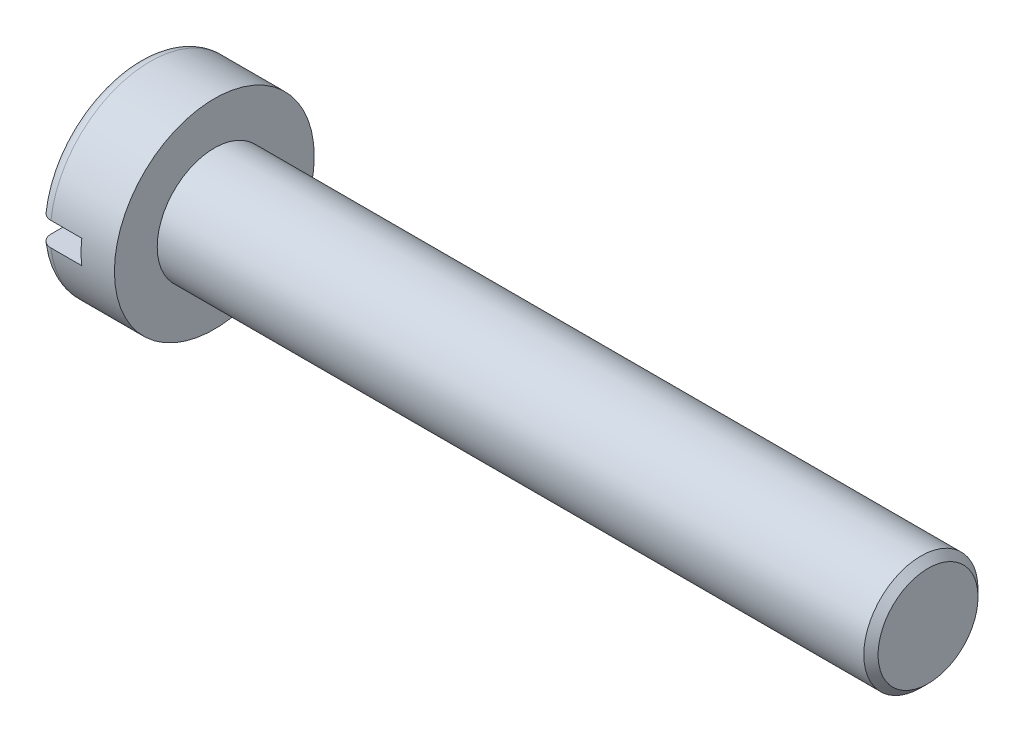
ISO-10303-21;
HEADER;
FILE_DESCRIPTION(('STEP AP214'),'2;1');
FILE_NAME('part.step','',(''),(''),'','','');
FILE_SCHEMA(('AUTOMOTIVE_DESIGN { 1 0 10303 214 1 1 1 1 }'));
ENDSEC;
DATA;
#1=APPLICATION_CONTEXT('core data for automotive mechanical design processes');
#2=APPLICATION_PROTOCOL_DEFINITION('international standard','automotive_design',2000,#1);
#3=PRODUCT_CONTEXT('',#1,'mechanical');
#4=PRODUCT('Part','Part','',(#3));
#5=PRODUCT_RELATED_PRODUCT_CATEGORY('part','',(#4));
#6=PRODUCT_DEFINITION_FORMATION('','',#4);
#7=PRODUCT_DEFINITION_CONTEXT('part definition',#1,'design');
#8=PRODUCT_DEFINITION('design','',#6,#7);
#9=PRODUCT_DEFINITION_SHAPE('','',#8);
#10=(LENGTH_UNIT() NAMED_UNIT(*) SI_UNIT(.MILLI.,.METRE.));
#11=(NAMED_UNIT(*) PLANE_ANGLE_UNIT() SI_UNIT($,.RADIAN.));
#12=(NAMED_UNIT(*) SI_UNIT($,.STERADIAN.) SOLID_ANGLE_UNIT());
#13=UNCERTAINTY_MEASURE_WITH_UNIT(LENGTH_MEASURE(1.E-05),#10,'distance_accuracy_value','');
#14=(GEOMETRIC_REPRESENTATION_CONTEXT(3) GLOBAL_UNCERTAINTY_ASSIGNED_CONTEXT((#13)) GLOBAL_UNIT_ASSIGNED_CONTEXT((#10,
#11,#12)) REPRESENTATION_CONTEXT('',''));
#15=CARTESIAN_POINT('',(0.,0.,0.));
#16=DIRECTION('',(0.,0.,1.));
#17=DIRECTION('',(1.,0.,0.));
#18=AXIS2_PLACEMENT_3D('',#15,#16,#17);
#19=CARTESIAN_POINT('',(3.2,0.,0.));
#20=DIRECTION('',(-1.,0.,0.));
#21=DIRECTION('',(0.,0.,1.));
#22=AXIS2_PLACEMENT_3D('',#19,#20,#21);
#23=PLANE('',#22);
#24=CARTESIAN_POINT('',(3.2,0.,0.));
#25=DIRECTION('',(-1.,0.,0.));
#26=DIRECTION('',(0.,0.,1.));
#27=AXIS2_PLACEMENT_3D('',#24,#25,#26);
#28=CIRCLE('',#27,4.2);
#29=CARTESIAN_POINT('',(3.2,0.,4.2));
#30=VERTEX_POINT('',#29);
#31=EDGE_CURVE('E196',#30,#30,#28,.T.);
#32=ORIENTED_EDGE('',*,*,#31,.F.);
#33=EDGE_LOOP('',(#32));
#34=FACE_BOUND('',#33,.T.);
#35=CARTESIAN_POINT('',(3.2,0.,0.));
#36=DIRECTION('',(-1.,0.,0.));
#37=DIRECTION('',(0.,0.,1.));
#38=AXIS2_PLACEMENT_3D('',#35,#36,#37);
#39=CIRCLE('',#38,2.4);
#40=CARTESIAN_POINT('',(3.2,0.,2.4));
#41=VERTEX_POINT('',#40);
#42=EDGE_CURVE('E123',#41,#41,#39,.F.);
#43=ORIENTED_EDGE('',*,*,#42,.F.);
#44=EDGE_LOOP('',(#43));
#45=FACE_BOUND('',#44,.T.);
#46=ADVANCED_FACE('F31',(#34,#45),#23,.F.);
#47=CARTESIAN_POINT('',(0.,0.,0.));
#48=DIRECTION('',(1.,0.,0.));
#49=DIRECTION('',(0.,0.,-1.));
#50=AXIS2_PLACEMENT_3D('',#47,#48,#49);
#51=PLANE('',#50);
#52=CARTESIAN_POINT('',(0.,0.,0.));
#53=DIRECTION('',(-1.,0.,0.));
#54=DIRECTION('',(0.,0.,1.));
#55=AXIS2_PLACEMENT_3D('',#52,#53,#54);
#56=CIRCLE('',#55,3.7);
#57=CARTESIAN_POINT('',(0.,0.5,3.66606055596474));
#58=VERTEX_POINT('',#57);
#59=CARTESIAN_POINT('',(0.,0.5,-3.66606055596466));
#60=VERTEX_POINT('',#59);
#61=EDGE_CURVE('E101',#58,#60,#56,.T.);
#62=ORIENTED_EDGE('',*,*,#61,.T.);
#63=DIRECTION('',(0.,0.,1.));
#64=VECTOR('',#63,1.);
#65=CARTESIAN_POINT('',(0.,0.5,-5.));
#66=LINE('',#65,#64);
#67=EDGE_CURVE('E94',#60,#58,#66,.T.);
#68=ORIENTED_EDGE('',*,*,#67,.T.);
#69=EDGE_LOOP('',(#62,#68));
#70=FACE_BOUND('',#69,.T.);
#71=ADVANCED_FACE('F141',(#70),#51,.F.);
#72=CARTESIAN_POINT('',(0.5,0.,0.));
#73=DIRECTION('',(-1.,0.,0.));
#74=DIRECTION('',(0.,0.,1.));
#75=AXIS2_PLACEMENT_3D('',#72,#73,#74);
#76=TOROIDAL_SURFACE('',#75,3.7,0.5);
#77=CARTESIAN_POINT('',(0.500000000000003,0.,0.));
#78=DIRECTION('',(-1.,0.,0.));
#79=DIRECTION('',(0.,0.,1.));
#80=AXIS2_PLACEMENT_3D('',#77,#78,#79);
#81=CIRCLE('',#80,4.2);
#82=CARTESIAN_POINT('',(0.500000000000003,0.5,4.17013189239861));
#83=VERTEX_POINT('',#82);
#84=CARTESIAN_POINT('',(0.500000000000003,0.5,-4.17013189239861));
#85=VERTEX_POINT('',#84);
#86=EDGE_CURVE('E102',#83,#85,#81,.T.);
#87=ORIENTED_EDGE('',*,*,#86,.T.);
#88=CARTESIAN_POINT('',(0.157998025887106,0.5,-4.03386965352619));
#89=CARTESIAN_POINT('',(0.137412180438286,0.5,-4.01441757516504));
#90=CARTESIAN_POINT('',(0.118463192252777,0.5,-3.99320166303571));
#91=CARTESIAN_POINT('',(0.0843886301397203,0.5,-3.94786589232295));
#92=CARTESIAN_POINT('',(0.0692680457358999,0.5,-3.92374230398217));
#93=CARTESIAN_POINT('',(0.0432944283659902,0.5,-3.87332056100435));
#94=CARTESIAN_POINT('',(0.0324379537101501,0.5,-3.84702418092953));
#95=CARTESIAN_POINT('',(0.0152697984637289,0.5,-3.79299650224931));
#96=CARTESIAN_POINT('',(0.00895699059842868,0.5,-3.76526556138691));
#97=CARTESIAN_POINT('',(0.00101167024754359,0.5,-3.70898212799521));
#98=CARTESIAN_POINT('',(-0.00059437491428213,0.5,-3.68042589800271));
#99=CARTESIAN_POINT('',(0.000986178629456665,0.5,-3.62344484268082));
#100=CARTESIAN_POINT('',(0.00417313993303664,0.5,-3.59502002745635));
#101=CARTESIAN_POINT('',(0.0152755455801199,0.5,-3.5389709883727));
#102=CARTESIAN_POINT('',(0.0232129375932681,0.5,-3.51135110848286));
#103=CARTESIAN_POINT('',(0.0436161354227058,0.5,-3.45783714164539));
#104=CARTESIAN_POINT('',(0.0560819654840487,0.5,-3.43194306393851));
#105=CARTESIAN_POINT('',(0.085185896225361,0.5,-3.38265105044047));
#106=CARTESIAN_POINT('',(0.101819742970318,0.5,-3.35925060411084));
#107=CARTESIAN_POINT('',(0.138807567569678,0.5,-3.31560112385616));
#108=CARTESIAN_POINT('',(0.159161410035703,0.5,-3.29535197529));
#109=CARTESIAN_POINT('',(0.20285214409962,0.5,-3.25875120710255));
#110=CARTESIAN_POINT('',(0.226165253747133,0.5,-3.24237120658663));
#111=CARTESIAN_POINT('',(0.275235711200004,0.5,-3.21380989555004));
#112=CARTESIAN_POINT('',(0.300992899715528,0.5,-3.20162831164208));
#113=CARTESIAN_POINT('',(0.353909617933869,0.5,-3.18195357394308));
#114=CARTESIAN_POINT('',(0.381050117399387,0.5,-3.17440923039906));
#115=CARTESIAN_POINT('',(0.436216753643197,0.5,-3.16402928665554));
#116=CARTESIAN_POINT('',(0.464242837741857,0.5,-3.16119340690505));
#117=CARTESIAN_POINT('',(0.520123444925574,0.5,-3.16032254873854));
#118=CARTESIAN_POINT('',(0.547977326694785,0.5,-3.16224582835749));
#119=CARTESIAN_POINT('',(0.602964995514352,0.5,-3.17074606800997));
#120=CARTESIAN_POINT('',(0.63009879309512,0.5,-3.17732295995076));
#121=CARTESIAN_POINT('',(0.682859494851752,0.5,-3.19492212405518));
#122=CARTESIAN_POINT('',(0.708487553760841,0.5,-3.20594093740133));
#123=CARTESIAN_POINT('',(0.757549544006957,0.5,-3.23209329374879));
#124=CARTESIAN_POINT('',(0.78098340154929,0.5,-3.24722697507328));
#125=CARTESIAN_POINT('',(0.825187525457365,0.5,-3.28129562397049));
#126=CARTESIAN_POINT('',(0.845936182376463,0.5,-3.30025862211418));
#127=CARTESIAN_POINT('',(0.883999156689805,0.5,-3.34136426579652));
#128=CARTESIAN_POINT('',(0.901313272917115,0.5,-3.3635070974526));
#129=CARTESIAN_POINT('',(0.932219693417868,0.5,-3.41061053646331));
#130=CARTESIAN_POINT('',(0.945768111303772,0.5,-3.43559994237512));
#131=CARTESIAN_POINT('',(0.968519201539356,0.5,-3.48748444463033));
#132=CARTESIAN_POINT('',(0.97772165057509,0.5,-3.51437963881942));
#133=CARTESIAN_POINT('',(0.991593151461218,0.5,-3.56956352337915));
#134=CARTESIAN_POINT('',(0.996222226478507,0.5,-3.59786226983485));
#135=CARTESIAN_POINT('',(1.00067717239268,0.5,-3.6548357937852));
#136=CARTESIAN_POINT('',(1.00050293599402,0.5,-3.68351057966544));
#137=CARTESIAN_POINT('',(0.995343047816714,0.5,-3.74049682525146));
#138=CARTESIAN_POINT('',(0.990345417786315,0.5,-3.76880720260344));
#139=CARTESIAN_POINT('',(0.975650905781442,0.5,-3.82418146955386));
#140=CARTESIAN_POINT('',(0.965954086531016,0.5,-3.85124537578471));
#141=CARTESIAN_POINT('',(0.942166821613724,0.5,-3.90324980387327));
#142=CARTESIAN_POINT('',(0.928092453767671,0.5,-3.92819767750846));
#143=CARTESIAN_POINT('',(0.895926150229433,0.5,-3.97535354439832));
#144=CARTESIAN_POINT('',(0.877834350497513,0.5,-3.99756163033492));
#145=CARTESIAN_POINT('',(0.83828513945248,0.5,-4.03843509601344));
#146=CARTESIAN_POINT('',(0.816852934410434,0.5,-4.05712486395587));
#147=CARTESIAN_POINT('',(0.771134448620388,0.5,-4.09060784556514));
#148=CARTESIAN_POINT('',(0.746848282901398,0.5,-4.10540121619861));
#149=CARTESIAN_POINT('',(0.696309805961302,0.5,-4.13055499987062));
#150=CARTESIAN_POINT('',(0.670073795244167,0.5,-4.14094816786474));
#151=CARTESIAN_POINT('',(0.616224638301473,0.5,-4.15715477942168));
#152=CARTESIAN_POINT('',(0.588611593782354,0.5,-4.16296856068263));
#153=CARTESIAN_POINT('',(0.532954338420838,0.5,-4.16982542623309));
#154=CARTESIAN_POINT('',(0.504913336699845,0.5,-4.17089458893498));
#155=CARTESIAN_POINT('',(0.449043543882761,0.5,-4.16830105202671));
#156=CARTESIAN_POINT('',(0.421214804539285,0.5,-4.16463723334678));
#157=CARTESIAN_POINT('',(0.366604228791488,0.5,-4.1526934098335));
#158=CARTESIAN_POINT('',(0.339821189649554,0.5,-4.1444188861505));
#159=CARTESIAN_POINT('',(0.288043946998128,0.5,-4.12350467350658));
#160=CARTESIAN_POINT('',(0.263047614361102,0.5,-4.11087028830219));
#161=CARTESIAN_POINT('',(0.224722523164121,0.5,-4.08728071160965));
#162=CARTESIAN_POINT('',(0.210616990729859,0.5,-4.07756252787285));
#163=CARTESIAN_POINT('',(0.183474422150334,0.5,-4.05673412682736));
#164=CARTESIAN_POINT('',(0.170437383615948,0.5,-4.04562391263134));
#165=CARTESIAN_POINT('',(0.157998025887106,0.5,-4.03386965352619));
#166=B_SPLINE_CURVE_WITH_KNOTS('',3,(#88,#89,#90,#91,#92,#93,#94,#95,#96,#97,#98,#99,#100,#101,
#102,#103,#104,#105,#106,#107,#108,#109,#110,#111,#112,#113,#114,#115,#116,#117,#118,#119,#120,
#121,#122,#123,#124,#125,#126,#127,#128,#129,#130,#131,#132,#133,#134,#135,#136,#137,#138,#139,
#140,#141,#142,#143,#144,#145,#146,#147,#148,#149,#150,#151,#152,#153,#154,#155,#156,#157,#158,
#159,#160,#161,#162,#163,#164,#165),.UNSPECIFIED.,.T.,.F.,(4,2,2,2,2,2,2,2,2,2,2,2,2,2,2,2,2,2,
2,2,2,2,2,2,2,2,2,2,2,2,2,2,2,2,2,2,2,2,4),(0.,0.0849042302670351,0.169918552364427,
0.254864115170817,0.339788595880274,0.425189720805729,0.510597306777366,0.596402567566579,
0.682208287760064,0.767926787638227,0.853642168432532,0.93870780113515,1.02376789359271,
1.10787131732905,1.19196974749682,1.27533318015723,1.35869539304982,1.4419928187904,
1.52529304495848,1.60922670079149,1.6931652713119,1.77804457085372,1.86292823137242,
1.94854748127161,2.03416864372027,2.12000298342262,2.20583617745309,2.29135777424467,
2.37687647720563,2.4617785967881,2.54667729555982,2.6309323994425,2.71518128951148,
2.79896653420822,2.88277159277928,2.96647723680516,3.05008141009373,3.10138639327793,
3.1526912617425),.UNSPECIFIED.);
#167=EDGE_CURVE('E54',#85,#60,#166,.T.);
#168=ORIENTED_EDGE('',*,*,#167,.T.);
#169=ORIENTED_EDGE('',*,*,#61,.F.);
#170=CARTESIAN_POINT('',(0.404900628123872,0.5,3.16993649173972));
#171=CARTESIAN_POINT('',(0.377452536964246,0.5,3.17532124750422));
#172=CARTESIAN_POINT('',(0.350441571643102,0.5,3.18304417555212));
#173=CARTESIAN_POINT('',(0.298083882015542,0.5,3.20293605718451));
#174=CARTESIAN_POINT('',(0.272739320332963,0.5,3.21511065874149));
#175=CARTESIAN_POINT('',(0.22447032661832,0.5,3.24352369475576));
#176=CARTESIAN_POINT('',(0.201543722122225,0.5,3.25975843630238));
#177=CARTESIAN_POINT('',(0.15872121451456,0.5,3.29581366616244));
#178=CARTESIAN_POINT('',(0.138824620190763,0.5,3.31563333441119));
#179=CARTESIAN_POINT('',(0.102444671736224,0.5,3.35846150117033));
#180=CARTESIAN_POINT('',(0.0859894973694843,0.5,3.38149393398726));
#181=CARTESIAN_POINT('',(0.0571324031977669,0.5,3.42997268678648));
#182=CARTESIAN_POINT('',(0.0447308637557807,0.5,3.45541923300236));
#183=CARTESIAN_POINT('',(0.0242076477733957,0.5,3.50828386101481));
#184=CARTESIAN_POINT('',(0.0161310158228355,0.5,3.53571943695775));
#185=CARTESIAN_POINT('',(0.00467263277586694,0.5,3.59155439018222));
#186=CARTESIAN_POINT('',(0.0012910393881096,0.5,3.61995379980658));
#187=CARTESIAN_POINT('',(-0.000685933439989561,0.5,3.67706064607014));
#188=CARTESIAN_POINT('',(0.000742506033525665,0.5,3.70576891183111));
#189=CARTESIAN_POINT('',(0.00840618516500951,0.5,3.76253700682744));
#190=CARTESIAN_POINT('',(0.0146414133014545,0.5,3.79059683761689));
#191=CARTESIAN_POINT('',(0.0317408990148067,0.5,3.84522111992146));
#192=CARTESIAN_POINT('',(0.0425978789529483,0.5,3.87178784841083));
#193=CARTESIAN_POINT('',(0.0686452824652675,0.5,3.92270508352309));
#194=CARTESIAN_POINT('',(0.083835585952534,0.5,3.94705565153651));
#195=CARTESIAN_POINT('',(0.118019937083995,0.5,3.9926838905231));
#196=CARTESIAN_POINT('',(0.136989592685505,0.5,4.01397983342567));
#197=CARTESIAN_POINT('',(0.178260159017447,0.5,4.05305361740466));
#198=CARTESIAN_POINT('',(0.200560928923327,0.5,4.0708316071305));
#199=CARTESIAN_POINT('',(0.247673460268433,0.5,4.10221823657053));
#200=CARTESIAN_POINT('',(0.272464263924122,0.5,4.11585833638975));
#201=CARTESIAN_POINT('',(0.323994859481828,0.5,4.13875169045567));
#202=CARTESIAN_POINT('',(0.350734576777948,0.5,4.14800511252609));
#203=CARTESIAN_POINT('',(0.405218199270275,0.5,4.16180468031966));
#204=CARTESIAN_POINT('',(0.43295451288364,0.5,4.166380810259));
#205=CARTESIAN_POINT('',(0.48880142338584,0.5,4.1707952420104));
#206=CARTESIAN_POINT('',(0.516912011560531,0.5,4.17063365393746));
#207=CARTESIAN_POINT('',(0.572615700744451,0.5,4.16558569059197));
#208=CARTESIAN_POINT('',(0.600210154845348,0.5,4.16071422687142));
#209=CARTESIAN_POINT('',(0.654190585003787,0.5,4.14641186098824));
#210=CARTESIAN_POINT('',(0.680576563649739,0.5,4.13698096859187));
#211=CARTESIAN_POINT('',(0.731421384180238,0.5,4.11382458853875));
#212=CARTESIAN_POINT('',(0.755878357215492,0.5,4.1000949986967));
#213=CARTESIAN_POINT('',(0.802154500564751,0.5,4.06874325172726));
#214=CARTESIAN_POINT('',(0.823973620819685,0.5,4.05112102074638));
#215=CARTESIAN_POINT('',(0.864470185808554,0.5,4.01239760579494));
#216=CARTESIAN_POINT('',(0.88313205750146,0.5,3.99128013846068));
#217=CARTESIAN_POINT('',(0.916676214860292,0.5,3.94623136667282));
#218=CARTESIAN_POINT('',(0.931558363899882,0.5,3.92229996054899));
#219=CARTESIAN_POINT('',(0.957237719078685,0.5,3.87211629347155));
#220=CARTESIAN_POINT('',(0.968004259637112,0.5,3.84584834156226));
#221=CARTESIAN_POINT('',(0.985011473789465,0.5,3.79188619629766));
#222=CARTESIAN_POINT('',(0.991251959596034,0.5,3.76419194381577));
#223=CARTESIAN_POINT('',(0.999075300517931,0.5,3.70794116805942));
#224=CARTESIAN_POINT('',(1.00062287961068,0.5,3.67937973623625));
#225=CARTESIAN_POINT('',(0.998925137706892,0.5,3.62239929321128));
#226=CARTESIAN_POINT('',(0.99567964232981,0.5,3.59398028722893));
#227=CARTESIAN_POINT('',(0.984461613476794,0.5,3.53795310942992));
#228=CARTESIAN_POINT('',(0.976467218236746,0.5,3.51034931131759));
#229=CARTESIAN_POINT('',(0.955953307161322,0.5,3.45687685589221));
#230=CARTESIAN_POINT('',(0.943433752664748,0.5,3.4310082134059));
#231=CARTESIAN_POINT('',(0.914227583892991,0.5,3.38177649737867));
#232=CARTESIAN_POINT('',(0.897545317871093,0.5,3.35841084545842));
#233=CARTESIAN_POINT('',(0.860467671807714,0.5,3.31483966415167));
#234=CARTESIAN_POINT('',(0.840072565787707,0.5,3.29463390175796));
#235=CARTESIAN_POINT('',(0.796310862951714,0.5,3.25812864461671));
#236=CARTESIAN_POINT('',(0.772968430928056,0.5,3.24180018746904));
#237=CARTESIAN_POINT('',(0.723841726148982,0.5,3.21334216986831));
#238=CARTESIAN_POINT('',(0.698056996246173,0.5,3.20121339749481));
#239=CARTESIAN_POINT('',(0.645084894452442,0.5,3.18164302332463));
#240=CARTESIAN_POINT('',(0.61791561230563,0.5,3.17415236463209));
#241=CARTESIAN_POINT('',(0.562723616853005,0.5,3.16389449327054));
#242=CARTESIAN_POINT('',(0.534702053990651,0.5,3.16112117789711));
#243=CARTESIAN_POINT('',(0.489604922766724,0.5,3.16050983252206));
#244=CARTESIAN_POINT('',(0.472536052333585,0.5,3.16116543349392));
#245=CARTESIAN_POINT('',(0.438557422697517,0.5,3.16423605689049));
#246=CARTESIAN_POINT('',(0.421647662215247,0.5,3.16665106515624));
#247=CARTESIAN_POINT('',(0.404900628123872,0.5,3.16993649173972));
#248=B_SPLINE_CURVE_WITH_KNOTS('',3,(#170,#171,#172,#173,#174,#175,#176,#177,#178,#179,#180,
#181,#182,#183,#184,#185,#186,#187,#188,#189,#190,#191,#192,#193,#194,#195,#196,#197,#198,#199,
#200,#201,#202,#203,#204,#205,#206,#207,#208,#209,#210,#211,#212,#213,#214,#215,#216,#217,#218,
#219,#220,#221,#222,#223,#224,#225,#226,#227,#228,#229,#230,#231,#232,#233,#234,#235,#236,#237,
#238,#239,#240,#241,#242,#243,#244,#245,#246,#247),.UNSPECIFIED.,.T.,.F.,(4,2,2,2,2,2,2,2,2,2,2,
2,2,2,2,2,2,2,2,2,2,2,2,2,2,2,2,2,2,2,2,2,2,2,2,2,2,2,4),(0.,0.0838508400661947,
0.167808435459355,0.251689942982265,0.335552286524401,0.420076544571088,0.504608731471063,
0.590005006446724,0.675404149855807,0.761226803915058,0.847049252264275,0.932737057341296,
1.01842248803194,1.10357184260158,1.18871759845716,1.27319876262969,1.35767669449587,
1.44160961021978,1.52554057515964,1.6092066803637,1.69287260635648,1.77661861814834,
1.86036621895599,1.94451556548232,2.02866795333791,2.11343567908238,2.19820692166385,
2.28361381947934,2.36902382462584,2.45483009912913,2.54063710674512,2.626354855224,
2.71206627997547,2.79711576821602,2.88218120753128,2.96633082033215,3.05037148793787,
3.10153221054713,3.15269252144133),.UNSPECIFIED.);
#249=EDGE_CURVE('E173',#58,#83,#248,.T.);
#250=ORIENTED_EDGE('',*,*,#249,.T.);
#251=EDGE_LOOP('',(#87,#168,#169,#250));
#252=FACE_BOUND('',#251,.T.);
#253=ADVANCED_FACE('F149',(#252),#76,.T.);
#254=CARTESIAN_POINT('',(0.,-0.5,-3.66606055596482));
#255=VERTEX_POINT('',#254);
#256=CARTESIAN_POINT('',(0.,-0.5,3.66606055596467));
#257=VERTEX_POINT('',#256);
#258=EDGE_CURVE('E98',#255,#257,#56,.T.);
#259=ORIENTED_EDGE('',*,*,#258,.T.);
#260=DIRECTION('',(0.,0.,1.));
#261=VECTOR('',#260,1.);
#262=CARTESIAN_POINT('',(0.,-0.5,-5.));
#263=LINE('',#262,#261);
#264=EDGE_CURVE('E85',#255,#257,#263,.T.);
#265=ORIENTED_EDGE('',*,*,#264,.F.);
#266=EDGE_LOOP('',(#259,#265));
#267=FACE_BOUND('',#266,.T.);
#268=ADVANCED_FACE('F33',(#267),#51,.F.);
#269=ORIENTED_EDGE('',*,*,#258,.F.);
#270=CARTESIAN_POINT('',(0.157998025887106,-0.5,-4.03386965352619));
#271=CARTESIAN_POINT('',(0.178364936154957,-0.5,-4.05311141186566));
#272=CARTESIAN_POINT('',(0.200363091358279,-0.5,-4.07065488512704));
#273=CARTESIAN_POINT('',(0.24700750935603,-0.5,-4.10181854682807));
#274=CARTESIAN_POINT('',(0.271656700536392,-0.5,-4.11543433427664));
#275=CARTESIAN_POINT('',(0.32289094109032,-0.5,-4.13832407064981));
#276=CARTESIAN_POINT('',(0.349475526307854,-0.5,-4.14759905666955));
#277=CARTESIAN_POINT('',(0.403821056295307,-0.5,-4.16153354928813));
#278=CARTESIAN_POINT('',(0.431581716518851,-0.5,-4.16619416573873));
#279=CARTESIAN_POINT('',(0.487396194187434,-0.5,-4.1707583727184));
#280=CARTESIAN_POINT('',(0.515448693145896,-0.5,-4.17067809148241));
#281=CARTESIAN_POINT('',(0.571141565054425,-0.5,-4.1658027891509));
#282=CARTESIAN_POINT('',(0.598781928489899,-0.5,-4.16100765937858));
#283=CARTESIAN_POINT('',(0.652832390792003,-0.5,-4.14685238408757));
#284=CARTESIAN_POINT('',(0.679243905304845,-0.5,-4.13749764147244));
#285=CARTESIAN_POINT('',(0.730127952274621,-0.5,-4.11449942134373));
#286=CARTESIAN_POINT('',(0.75460047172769,-0.5,-4.10085591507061));
#287=CARTESIAN_POINT('',(0.800992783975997,-0.5,-4.06962992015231));
#288=CARTESIAN_POINT('',(0.822904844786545,-0.5,-4.05203594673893));
#289=CARTESIAN_POINT('',(0.863486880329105,-0.5,-4.01343987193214));
#290=CARTESIAN_POINT('',(0.882156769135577,-0.5,-3.99243768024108));
#291=CARTESIAN_POINT('',(0.915852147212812,-0.5,-3.9474828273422));
#292=CARTESIAN_POINT('',(0.930854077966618,-0.5,-3.92351251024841));
#293=CARTESIAN_POINT('',(0.956656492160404,-0.5,-3.87340854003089));
#294=CARTESIAN_POINT('',(0.967456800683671,-0.5,-3.84727479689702));
#295=CARTESIAN_POINT('',(0.984637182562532,-0.5,-3.79336919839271));
#296=CARTESIAN_POINT('',(0.990982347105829,-0.5,-3.76558621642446));
#297=CARTESIAN_POINT('',(0.998951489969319,-0.5,-3.70935113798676));
#298=CARTESIAN_POINT('',(1.00057527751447,-0.5,-3.68089901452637));
#299=CARTESIAN_POINT('',(0.999059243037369,-0.5,-3.62393650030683));
#300=CARTESIAN_POINT('',(0.995888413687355,-0.5,-3.59542693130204));
#301=CARTESIAN_POINT('',(0.984816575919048,-0.5,-3.53934099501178));
#302=CARTESIAN_POINT('',(0.976915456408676,-0.5,-3.51176464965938));
#303=CARTESIAN_POINT('',(0.956577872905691,-0.5,-3.45827033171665));
#304=CARTESIAN_POINT('',(0.944131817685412,-0.5,-3.43235600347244));
#305=CARTESIAN_POINT('',(0.915047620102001,-0.5,-3.38299648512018));
#306=CARTESIAN_POINT('',(0.898409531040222,-0.5,-3.35955126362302));
#307=CARTESIAN_POINT('',(0.861482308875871,-0.5,-3.31591360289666));
#308=CARTESIAN_POINT('',(0.841209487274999,-0.5,-3.29570736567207));
#309=CARTESIAN_POINT('',(0.797529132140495,-0.5,-3.25902686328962));
#310=CARTESIAN_POINT('',(0.774121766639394,-0.5,-3.24255239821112));
#311=CARTESIAN_POINT('',(0.725085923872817,-0.5,-3.21398321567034));
#312=CARTESIAN_POINT('',(0.699482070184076,-0.5,-3.20184624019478));
#313=CARTESIAN_POINT('',(0.646585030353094,-0.5,-3.18209713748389));
#314=CARTESIAN_POINT('',(0.619291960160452,-0.5,-3.17448470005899));
#315=CARTESIAN_POINT('',(0.56410940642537,-0.5,-3.16407974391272));
#316=CARTESIAN_POINT('',(0.536229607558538,-0.5,-3.16123582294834));
#317=CARTESIAN_POINT('',(0.480390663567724,-0.5,-3.1602962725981));
#318=CARTESIAN_POINT('',(0.452431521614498,-0.5,-3.16220045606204));
#319=CARTESIAN_POINT('',(0.397380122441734,-0.5,-3.17067517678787));
#320=CARTESIAN_POINT('',(0.370284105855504,-0.5,-3.17722133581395));
#321=CARTESIAN_POINT('',(0.317569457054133,-0.5,-3.19475335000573));
#322=CARTESIAN_POINT('',(0.291950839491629,-0.5,-3.20573924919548));
#323=CARTESIAN_POINT('',(0.242809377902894,-0.5,-3.23187042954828));
#324=CARTESIAN_POINT('',(0.219294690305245,-0.5,-3.24703104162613));
#325=CARTESIAN_POINT('',(0.175110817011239,-0.5,-3.28104746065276));
#326=CARTESIAN_POINT('',(0.154441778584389,-0.5,-3.29990345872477));
#327=CARTESIAN_POINT('',(0.116309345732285,-0.5,-3.34097876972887));
#328=CARTESIAN_POINT('',(0.0988807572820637,-0.5,-3.36323039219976));
#329=CARTESIAN_POINT('',(0.0679596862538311,-0.5,-3.41031826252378));
#330=CARTESIAN_POINT('',(0.0544674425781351,-0.5,-3.43515466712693));
#331=CARTESIAN_POINT('',(0.0316568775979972,-0.5,-3.48699214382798));
#332=CARTESIAN_POINT('',(0.0223844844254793,-0.5,-3.5140134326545));
#333=CARTESIAN_POINT('',(0.00847833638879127,-0.5,-3.5692235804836));
#334=CARTESIAN_POINT('',(0.00384458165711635,-0.5,-3.59741243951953));
#335=CARTESIAN_POINT('',(-0.000668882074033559,-0.5,-3.65433079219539));
#336=CARTESIAN_POINT('',(-0.000521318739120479,-0.5,-3.68306245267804));
#337=CARTESIAN_POINT('',(0.00459920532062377,-0.5,-3.74010087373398));
#338=CARTESIAN_POINT('',(0.00957337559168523,-0.5,-3.76840752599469));
#339=CARTESIAN_POINT('',(0.0242151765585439,-0.5,-3.82376911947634));
#340=CARTESIAN_POINT('',(0.0338814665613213,-0.5,-3.85082441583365));
#341=CARTESIAN_POINT('',(0.0576407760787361,-0.5,-3.90288951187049));
#342=CARTESIAN_POINT('',(0.0717283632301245,-0.5,-3.92790177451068));
#343=CARTESIAN_POINT('',(0.0979938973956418,-0.5,-3.96646105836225));
#344=CARTESIAN_POINT('',(0.108969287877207,-0.5,-3.98084207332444));
#345=CARTESIAN_POINT('',(0.132402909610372,-0.5,-4.00834079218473));
#346=CARTESIAN_POINT('',(0.144861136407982,-0.5,-4.0214584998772));
#347=CARTESIAN_POINT('',(0.157998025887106,-0.5,-4.03386965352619));
#348=B_SPLINE_CURVE_WITH_KNOTS('',3,(#270,#271,#272,#273,#274,#275,#276,#277,#278,#279,#280,
#281,#282,#283,#284,#285,#286,#287,#288,#289,#290,#291,#292,#293,#294,#295,#296,#297,#298,#299,
#300,#301,#302,#303,#304,#305,#306,#307,#308,#309,#310,#311,#312,#313,#314,#315,#316,#317,#318,
#319,#320,#321,#322,#323,#324,#325,#326,#327,#328,#329,#330,#331,#332,#333,#334,#335,#336,#337,
#338,#339,#340,#341,#342,#343,#344,#345,#346,#347),.UNSPECIFIED.,.T.,.F.,(4,2,2,2,2,2,2,2,2,2,2,
2,2,2,2,2,2,2,2,2,2,2,2,2,2,2,2,2,2,2,2,2,2,2,2,2,2,2,4),(0.,0.0839911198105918,
0.168075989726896,0.252140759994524,0.336185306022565,0.419943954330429,0.503704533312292,
0.587366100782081,0.671028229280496,0.754936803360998,0.838847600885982,0.923283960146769,
1.00772383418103,1.09281817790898,1.17791595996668,1.26356643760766,1.34921892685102,
1.43505322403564,1.52088642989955,1.6063436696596,1.69179633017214,1.77639218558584,
1.86098224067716,1.94465445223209,2.02832336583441,2.11155609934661,2.19478965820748,
2.27833305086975,2.36188076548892,2.44627969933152,2.53068375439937,2.61598568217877,
2.70128761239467,2.78707618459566,2.87288626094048,2.95867183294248,3.0443524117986,
3.09852780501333,3.15270303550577),.UNSPECIFIED.);
#349=CARTESIAN_POINT('',(0.500000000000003,-0.5,-4.17013189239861));
#350=VERTEX_POINT('',#349);
#351=EDGE_CURVE('E82',#255,#350,#348,.T.);
#352=ORIENTED_EDGE('',*,*,#351,.T.);
#353=CARTESIAN_POINT('',(0.500000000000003,-0.5,4.17013189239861));
#354=VERTEX_POINT('',#353);
#355=EDGE_CURVE('E106',#350,#354,#81,.T.);
#356=ORIENTED_EDGE('',*,*,#355,.T.);
#357=CARTESIAN_POINT('',(0.404900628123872,-0.5,3.16993649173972));
#358=CARTESIAN_POINT('',(0.432155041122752,-0.5,3.16459236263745));
#359=CARTESIAN_POINT('',(0.459880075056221,-0.5,3.16154554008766));
#360=CARTESIAN_POINT('',(0.515469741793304,-0.5,3.16015435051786));
#361=CARTESIAN_POINT('',(0.543334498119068,-0.5,3.16181537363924));
#362=CARTESIAN_POINT('',(0.598375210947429,-0.5,3.16979391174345));
#363=CARTESIAN_POINT('',(0.62555154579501,-0.5,3.17610880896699));
#364=CARTESIAN_POINT('',(0.67845554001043,-0.5,3.19319783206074));
#365=CARTESIAN_POINT('',(0.704183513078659,-0.5,3.20397098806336));
#366=CARTESIAN_POINT('',(0.75355506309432,-0.5,3.22968972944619));
#367=CARTESIAN_POINT('',(0.777192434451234,-0.5,3.24464722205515));
#368=CARTESIAN_POINT('',(0.821654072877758,-0.5,3.2782814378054));
#369=CARTESIAN_POINT('',(0.842478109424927,-0.5,3.29695846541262));
#370=CARTESIAN_POINT('',(0.880947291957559,-0.5,3.3377003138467));
#371=CARTESIAN_POINT('',(0.898558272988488,-0.5,3.35979739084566));
#372=CARTESIAN_POINT('',(0.929867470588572,-0.5,3.40660837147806));
#373=CARTESIAN_POINT('',(0.943565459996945,-0.5,3.43132242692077));
#374=CARTESIAN_POINT('',(0.966808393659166,-0.5,3.4829508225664));
#375=CARTESIAN_POINT('',(0.976307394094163,-0.5,3.50988585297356));
#376=CARTESIAN_POINT('',(0.990679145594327,-0.5,3.56496331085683));
#377=CARTESIAN_POINT('',(0.995551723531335,-0.5,3.59310578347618));
#378=CARTESIAN_POINT('',(1.00055024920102,-0.5,3.64997937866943));
#379=CARTESIAN_POINT('',(1.00064768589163,-0.5,3.67871301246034));
#380=CARTESIAN_POINT('',(0.996014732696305,-0.5,3.73578895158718));
#381=CARTESIAN_POINT('',(0.99128431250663,-0.5,3.76413125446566));
#382=CARTESIAN_POINT('',(0.977122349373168,-0.5,3.81959854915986));
#383=CARTESIAN_POINT('',(0.967693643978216,-0.5,3.84672426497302));
#384=CARTESIAN_POINT('',(0.944390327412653,-0.5,3.89899415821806));
#385=CARTESIAN_POINT('',(0.930515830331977,-0.5,3.92413838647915));
#386=CARTESIAN_POINT('',(0.898795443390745,-0.5,3.97157497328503));
#387=CARTESIAN_POINT('',(0.880972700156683,-0.5,3.99388280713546));
#388=CARTESIAN_POINT('',(0.841808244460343,-0.5,4.03516012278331));
#389=CARTESIAN_POINT('',(0.820466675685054,-0.5,4.05412974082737));
#390=CARTESIAN_POINT('',(0.77504846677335,-0.5,4.08803548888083));
#391=CARTESIAN_POINT('',(0.750994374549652,-0.5,4.10300182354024));
#392=CARTESIAN_POINT('',(0.700701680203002,-0.5,4.12865138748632));
#393=CARTESIAN_POINT('',(0.674463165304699,-0.5,4.13933478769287));
#394=CARTESIAN_POINT('',(0.620739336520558,-0.5,4.15604281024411));
#395=CARTESIAN_POINT('',(0.593263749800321,-0.5,4.16209871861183));
#396=CARTESIAN_POINT('',(0.537685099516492,-0.5,4.16949245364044));
#397=CARTESIAN_POINT('',(0.509582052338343,-0.5,4.17083040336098));
#398=CARTESIAN_POINT('',(0.453658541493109,-0.5,4.16875269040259));
#399=CARTESIAN_POINT('',(0.425837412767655,-0.5,4.16535487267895));
#400=CARTESIAN_POINT('',(0.371160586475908,-0.5,4.1539377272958));
#401=CARTESIAN_POINT('',(0.34430488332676,-0.5,4.14591842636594));
#402=CARTESIAN_POINT('',(0.29230956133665,-0.5,4.12549051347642));
#403=CARTESIAN_POINT('',(0.267170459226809,-0.5,4.1130805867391));
#404=CARTESIAN_POINT('',(0.219320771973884,-0.5,4.08423342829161));
#405=CARTESIAN_POINT('',(0.196610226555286,-0.5,4.06779613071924));
#406=CARTESIAN_POINT('',(0.154155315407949,-0.5,4.03129037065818));
#407=CARTESIAN_POINT('',(0.134423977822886,-0.5,4.01120675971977));
#408=CARTESIAN_POINT('',(0.0985847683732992,-0.5,3.96803231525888));
#409=CARTESIAN_POINT('',(0.0824770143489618,-0.5,3.94494138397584));
#410=CARTESIAN_POINT('',(0.0542194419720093,-0.5,3.89623494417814));
#411=CARTESIAN_POINT('',(0.0420983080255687,-0.5,3.87060279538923));
#412=CARTESIAN_POINT('',(0.0222942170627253,-0.5,3.81767791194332));
#413=CARTESIAN_POINT('',(0.0146114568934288,-0.5,3.79038510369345));
#414=CARTESIAN_POINT('',(0.00384304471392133,-0.5,3.73469002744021));
#415=CARTESIAN_POINT('',(0.000793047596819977,-0.5,3.7062808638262));
#416=CARTESIAN_POINT('',(-0.000521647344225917,-0.5,3.64935173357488));
#417=CARTESIAN_POINT('',(0.00121383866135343,-0.5,3.62083176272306));
#418=CARTESIAN_POINT('',(0.00944021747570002,-0.5,3.56433039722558));
#419=CARTESIAN_POINT('',(0.0159563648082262,-0.5,3.5363526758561));
#420=CARTESIAN_POINT('',(0.0335924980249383,-0.5,3.48188838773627));
#421=CARTESIAN_POINT('',(0.0447123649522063,-0.5,3.4554017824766));
#422=CARTESIAN_POINT('',(0.0712498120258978,-0.5,3.40468055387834));
#423=CARTESIAN_POINT('',(0.0866668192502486,-0.5,3.38044563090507));
#424=CARTESIAN_POINT('',(0.121380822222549,-0.5,3.33492366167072));
#425=CARTESIAN_POINT('',(0.140678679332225,-0.5,3.31363727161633));
#426=CARTESIAN_POINT('',(0.182479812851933,-0.5,3.27477524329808));
#427=CARTESIAN_POINT('',(0.204962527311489,-0.5,3.25717747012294));
#428=CARTESIAN_POINT('',(0.252573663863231,-0.5,3.22607489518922));
#429=CARTESIAN_POINT('',(0.277698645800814,-0.5,3.21256485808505));
#430=CARTESIAN_POINT('',(0.320008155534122,-0.5,3.19429057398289));
#431=CARTESIAN_POINT('',(0.336612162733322,-0.5,3.18814973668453));
#432=CARTESIAN_POINT('',(0.370380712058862,-0.5,3.17767424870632));
#433=CARTESIAN_POINT('',(0.387545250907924,-0.5,3.17333958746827));
#434=CARTESIAN_POINT('',(0.404900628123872,-0.5,3.16993649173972));
#435=B_SPLINE_CURVE_WITH_KNOTS('',3,(#357,#358,#359,#360,#361,#362,#363,#364,#365,#366,#367,
#368,#369,#370,#371,#372,#373,#374,#375,#376,#377,#378,#379,#380,#381,#382,#383,#384,#385,#386,
#387,#388,#389,#390,#391,#392,#393,#394,#395,#396,#397,#398,#399,#400,#401,#402,#403,#404,#405,
#406,#407,#408,#409,#410,#411,#412,#413,#414,#415,#416,#417,#418,#419,#420,#421,#422,#423,#424,
#425,#426,#427,#428,#429,#430,#431,#432,#433,#434),.UNSPECIFIED.,.T.,.F.,(4,2,2,2,2,2,2,2,2,2,2,
2,2,2,2,2,2,2,2,2,2,2,2,2,2,2,2,2,2,2,2,2,2,2,2,2,2,2,4),(0.,0.0832556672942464,
0.166606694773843,0.249910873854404,0.333196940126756,0.4167224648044,0.500254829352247,
0.58462933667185,0.669008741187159,0.754289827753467,0.839574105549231,0.925367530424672,
1.01116149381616,1.09690370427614,1.18264371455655,1.26789378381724,1.35314037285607,
1.43772437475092,1.52230500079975,1.6063085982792,1.69031000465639,1.77399573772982,
1.85768098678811,1.94139131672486,2.02510301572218,2.10917079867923,2.19324131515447,
2.27790413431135,2.3625707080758,2.44788565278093,2.53320387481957,2.61897607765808,
2.70474606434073,2.7905046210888,2.87628223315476,2.96152935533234,3.04666683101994,
3.09968363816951,3.15270013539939),.UNSPECIFIED.);
#436=EDGE_CURVE('E93',#354,#257,#435,.T.);
#437=ORIENTED_EDGE('',*,*,#436,.T.);
#438=EDGE_LOOP('',(#269,#352,#356,#437));
#439=FACE_BOUND('',#438,.T.);
#440=ADVANCED_FACE('F100',(#439),#76,.T.);
#441=CARTESIAN_POINT('',(0.,0.,0.));
#442=DIRECTION('',(-1.,0.,0.));
#443=DIRECTION('',(0.,0.,1.));
#444=AXIS2_PLACEMENT_3D('',#441,#442,#443);
#445=CYLINDRICAL_SURFACE('',#444,4.2);
#446=ORIENTED_EDGE('',*,*,#86,.F.);
#447=DIRECTION('',(-1.,0.,0.));
#448=VECTOR('',#447,1.);
#449=CARTESIAN_POINT('',(0.,0.5,4.17013189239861));
#450=LINE('',#449,#448);
#451=CARTESIAN_POINT('',(1.8,0.5,4.17013189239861));
#452=VERTEX_POINT('',#451);
#453=EDGE_CURVE('E120',#83,#452,#450,.F.);
#454=ORIENTED_EDGE('',*,*,#453,.T.);
#455=CARTESIAN_POINT('',(1.8,0.,0.));
#456=DIRECTION('',(1.,0.,0.));
#457=DIRECTION('',(0.,0.,-1.));
#458=AXIS2_PLACEMENT_3D('',#455,#456,#457);
#459=CIRCLE('',#458,4.2);
#460=CARTESIAN_POINT('',(1.8,-0.5,4.17013189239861));
#461=VERTEX_POINT('',#460);
#462=EDGE_CURVE('E115',#452,#461,#459,.T.);
#463=ORIENTED_EDGE('',*,*,#462,.T.);
#464=DIRECTION('',(-1.,0.,0.));
#465=VECTOR('',#464,1.);
#466=CARTESIAN_POINT('',(0.,-0.5,4.17013189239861));
#467=LINE('',#466,#465);
#468=EDGE_CURVE('E117',#461,#354,#467,.T.);
#469=ORIENTED_EDGE('',*,*,#468,.T.);
#470=ORIENTED_EDGE('',*,*,#355,.F.);
#471=DIRECTION('',(-1.,0.,0.));
#472=VECTOR('',#471,1.);
#473=CARTESIAN_POINT('',(0.,-0.5,-4.17013189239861));
#474=LINE('',#473,#472);
#475=CARTESIAN_POINT('',(1.8,-0.5,-4.17013189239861));
#476=VERTEX_POINT('',#475);
#477=EDGE_CURVE('E88',#350,#476,#474,.F.);
#478=ORIENTED_EDGE('',*,*,#477,.T.);
#479=CARTESIAN_POINT('',(1.8,0.5,-4.17013189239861));
#480=VERTEX_POINT('',#479);
#481=EDGE_CURVE('E111',#476,#480,#459,.T.);
#482=ORIENTED_EDGE('',*,*,#481,.T.);
#483=DIRECTION('',(-1.,0.,0.));
#484=VECTOR('',#483,1.);
#485=CARTESIAN_POINT('',(0.,0.5,-4.17013189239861));
#486=LINE('',#485,#484);
#487=EDGE_CURVE('E114',#480,#85,#486,.T.);
#488=ORIENTED_EDGE('',*,*,#487,.T.);
#489=EDGE_LOOP('',(#446,#454,#463,#469,#470,#478,#482,#488));
#490=FACE_BOUND('',#489,.T.);
#491=ORIENTED_EDGE('',*,*,#31,.T.);
#492=EDGE_LOOP('',(#491));
#493=FACE_BOUND('',#492,.T.);
#494=ADVANCED_FACE('F157',(#490,#493),#445,.T.);
#495=CARTESIAN_POINT('',(0.,0.5,-5.));
#496=DIRECTION('',(0.,1.,0.));
#497=DIRECTION('',(0.,0.,1.));
#498=AXIS2_PLACEMENT_3D('',#495,#496,#497);
#499=PLANE('',#498);
#500=ORIENTED_EDGE('',*,*,#487,.F.);
#501=DIRECTION('',(0.,0.,1.));
#502=VECTOR('',#501,1.);
#503=CARTESIAN_POINT('',(1.8,0.5,-5.));
#504=LINE('',#503,#502);
#505=EDGE_CURVE('E191',#480,#452,#504,.T.);
#506=ORIENTED_EDGE('',*,*,#505,.T.);
#507=ORIENTED_EDGE('',*,*,#453,.F.);
#508=ORIENTED_EDGE('',*,*,#249,.F.);
#509=ORIENTED_EDGE('',*,*,#67,.F.);
#510=ORIENTED_EDGE('',*,*,#167,.F.);
#511=EDGE_LOOP('',(#500,#506,#507,#508,#509,#510));
#512=FACE_BOUND('',#511,.T.);
#513=ADVANCED_FACE('F159',(#512),#499,.F.);
#514=CARTESIAN_POINT('',(1.8,-0.5,-5.));
#515=DIRECTION('',(1.,0.,0.));
#516=DIRECTION('',(0.,0.,-1.));
#517=AXIS2_PLACEMENT_3D('',#514,#515,#516);
#518=PLANE('',#517);
#519=ORIENTED_EDGE('',*,*,#505,.F.);
#520=ORIENTED_EDGE('',*,*,#481,.F.);
#521=DIRECTION('',(0.,0.,1.));
#522=VECTOR('',#521,1.);
#523=CARTESIAN_POINT('',(1.8,-0.5,-5.));
#524=LINE('',#523,#522);
#525=EDGE_CURVE('E46',#476,#461,#524,.T.);
#526=ORIENTED_EDGE('',*,*,#525,.T.);
#527=ORIENTED_EDGE('',*,*,#462,.F.);
#528=EDGE_LOOP('',(#519,#520,#526,#527));
#529=FACE_BOUND('',#528,.T.);
#530=ADVANCED_FACE('F183',(#529),#518,.F.);
#531=CARTESIAN_POINT('',(0.,-0.5,-5.));
#532=DIRECTION('',(0.,-1.,0.));
#533=DIRECTION('',(0.,0.,-1.));
#534=AXIS2_PLACEMENT_3D('',#531,#532,#533);
#535=PLANE('',#534);
#536=ORIENTED_EDGE('',*,*,#468,.F.);
#537=ORIENTED_EDGE('',*,*,#525,.F.);
#538=ORIENTED_EDGE('',*,*,#477,.F.);
#539=ORIENTED_EDGE('',*,*,#351,.F.);
#540=ORIENTED_EDGE('',*,*,#264,.T.);
#541=ORIENTED_EDGE('',*,*,#436,.F.);
#542=EDGE_LOOP('',(#536,#537,#538,#539,#540,#541));
#543=FACE_BOUND('',#542,.T.);
#544=ADVANCED_FACE('F84',(#543),#535,.F.);
#545=CARTESIAN_POINT('',(33.2,0.,0.));
#546=DIRECTION('',(-1.,0.,0.));
#547=DIRECTION('',(0.,0.,1.));
#548=AXIS2_PLACEMENT_3D('',#545,#546,#547);
#549=CYLINDRICAL_SURFACE('',#548,2.4);
#550=CARTESIAN_POINT('',(32.9,0.,0.));
#551=DIRECTION('',(1.,0.,0.));
#552=DIRECTION('',(0.,0.,-1.));
#553=AXIS2_PLACEMENT_3D('',#550,#551,#552);
#554=CIRCLE('',#553,2.4);
#555=CARTESIAN_POINT('',(32.9,0.,-2.4));
#556=VERTEX_POINT('',#555);
#557=EDGE_CURVE('E11',#556,#556,#554,.F.);
#558=ORIENTED_EDGE('',*,*,#557,.T.);
#559=EDGE_LOOP('',(#558));
#560=FACE_BOUND('',#559,.T.);
#561=ORIENTED_EDGE('',*,*,#42,.T.);
#562=EDGE_LOOP('',(#561));
#563=FACE_BOUND('',#562,.T.);
#564=ADVANCED_FACE('F137',(#560,#563),#549,.T.);
#565=CARTESIAN_POINT('',(33.2,0.,0.));
#566=DIRECTION('',(1.,0.,0.));
#567=DIRECTION('',(0.,0.,-1.));
#568=AXIS2_PLACEMENT_3D('',#565,#566,#567);
#569=PLANE('',#568);
#570=CARTESIAN_POINT('',(33.2,0.,0.));
#571=DIRECTION('',(1.,0.,0.));
#572=DIRECTION('',(0.,0.,-1.));
#573=AXIS2_PLACEMENT_3D('',#570,#571,#572);
#574=CIRCLE('',#573,2.1);
#575=CARTESIAN_POINT('',(33.2,0.,-2.1));
#576=VERTEX_POINT('',#575);
#577=EDGE_CURVE('E39',#576,#576,#574,.T.);
#578=ORIENTED_EDGE('',*,*,#577,.T.);
#579=EDGE_LOOP('',(#578));
#580=FACE_BOUND('',#579,.T.);
#581=ADVANCED_FACE('F128',(#580),#569,.T.);
#582=CARTESIAN_POINT('',(33.2,0.,0.));
#583=DIRECTION('',(-1.,0.,0.));
#584=DIRECTION('',(0.,0.,1.));
#585=AXIS2_PLACEMENT_3D('',#582,#583,#584);
#586=CONICAL_SURFACE('',#585,2.1,0.785398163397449);
#587=ORIENTED_EDGE('',*,*,#557,.F.);
#588=EDGE_LOOP('',(#587));
#589=FACE_BOUND('',#588,.T.);
#590=ORIENTED_EDGE('',*,*,#577,.F.);
#591=EDGE_LOOP('',(#590));
#592=FACE_BOUND('',#591,.T.);
#593=ADVANCED_FACE('F130',(#589,#592),#586,.T.);
#594=CLOSED_SHELL('',(#46,#71,#253,#268,#440,#494,#513,#530,#544,#564,#581,#593));
#595=MANIFOLD_SOLID_BREP('B2',#594);
#596=ADVANCED_BREP_SHAPE_REPRESENTATION('',(#18,#595),#14);
#597=SHAPE_DEFINITION_REPRESENTATION(#9,#596);
ENDSEC;
END-ISO-10303-21;
